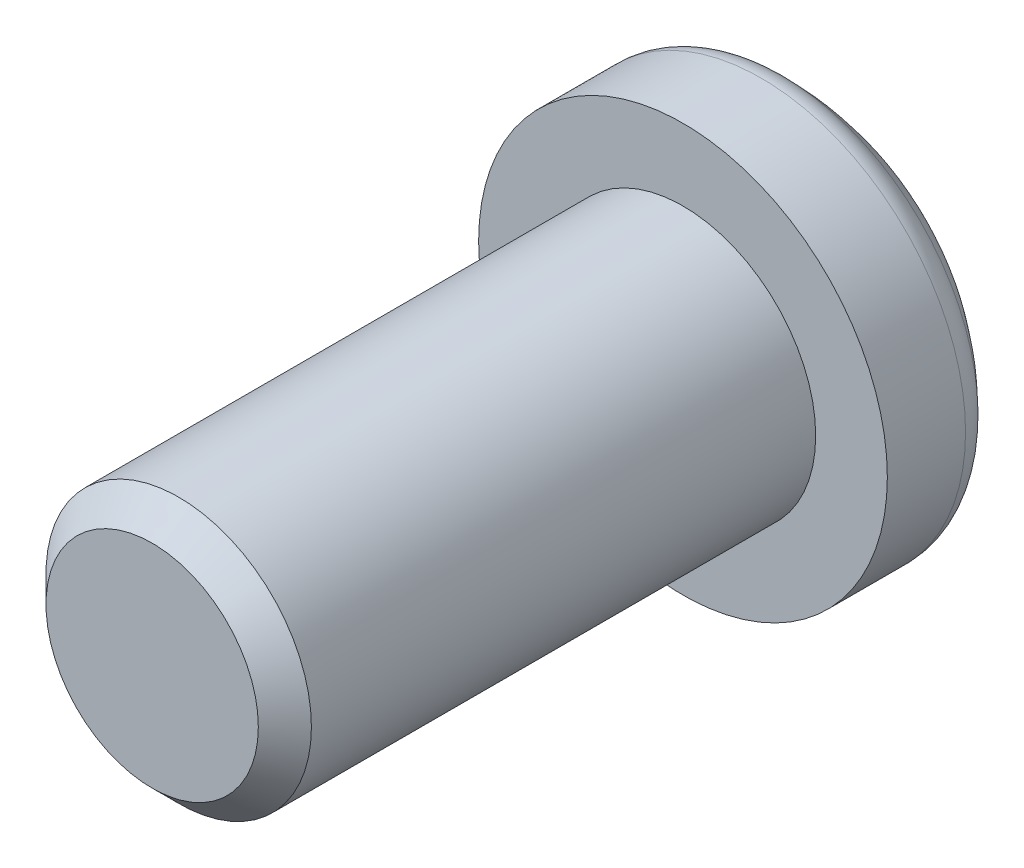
from build123d import *

# Parameters (mm, degrees)
ENLEV_MAT_EXTRU_1_DEPTH = 1.2
ESQUISSE3_W             = 2.5
ESQUISSE3_H             = 10
CHANFREIN1_SIZE         = 0.5
ENL_V_MAT_EXTRU_1_DEPTH = 2


with BuildPart() as part:
    # Esquisse1 → Base-R_volution (revolve)
    with BuildSketch(Plane(origin=(0, 0, 0), x_dir=(1, 0, 0), z_dir=(0, 1, 0)), mode=Mode.PRIVATE) as base_r_volution_sk:
        with BuildLine():
            Line((0, 0), (3.85, 0))
            Line((3.85, 0), (3.85, 1.47314887))
            ThreePointArc((3.85, 1.47314887), (3.806875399, 1.689977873), (3.684065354, 1.873804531))
            ThreePointArc((3.684065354, 1.873804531), (1.993841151, 3.003350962), (0, 3.4))
            Line((0, 3.4), (0, 0))
        make_face()
    revolve(base_r_volution_sk.sketch.rotate(Axis((0, 0, 0), (0, 0, -1)), 180), axis=Axis((0, 0, 0), (0, 0, -1)))

    # Esquisse2 → Enlev. mat.-Extru.1 (cut)
    with BuildSketch(Plane.XY.offset(-3.4)):
        Polygon((0.6, -0.6), (0.6, -2.35), (-0.6, -2.35), (-0.6, -0.6), (-2.35, -0.6), (-2.35, 0.6), (-0.6, 0.6), (-0.6, 2.35), (0.6, 2.35), (0.6, 0.6), (2.35, 0.6), (2.35, -0.6), align=None)
    extrude(amount=ENLEV_MAT_EXTRU_1_DEPTH, mode=Mode.SUBTRACT)

    # Esquisse3 → Boss.-R_vol.1 (revolve)
    with BuildSketch(Plane(origin=(0, 0, 0), x_dir=(1, 0, 0), z_dir=(0, 1, 0)), mode=Mode.PRIVATE) as boss_r_vol_1_sk:
        with Locations((1.25, -5)):
            Rectangle(ESQUISSE3_W, ESQUISSE3_H)
    revolve(boss_r_vol_1_sk.sketch.rotate(Axis((0, 0, 0), (0, 0, 1)), 345.677280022), axis=Axis((0, 0, 0), (0, 0, 1)))

    # Chanfrein1
    chanfrein1_edges = [part.edges().sort_by_distance(p)[0] for p in [
        (-2.422294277, 0.618458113, 10),
    ]]
    chamfer(chanfrein1_edges, length=CHANFREIN1_SIZE)

    # Esquisse6 → Enl_v. mat.-Extru.1 (cut)
    with BuildSketch(Plane(origin=(0, 0, -2.2), x_dir=(-1, 0, 0), z_dir=(0, 0, -1))):
        Polygon((2.35, -0.6), (2.35, 0.6), (0.6, 0.6), (0.6, 2.35), (-0.6, 2.35), (-0.6, 0.6), (-2.35, 0.6), (-2.35, -0.6), (-0.6, -0.6), (-0.6, -2.35), (0.6, -2.35), (0.6, -0.6), align=None)
    extrude(amount=-ENL_V_MAT_EXTRU_1_DEPTH, mode=Mode.SUBTRACT)


solid = part.part
